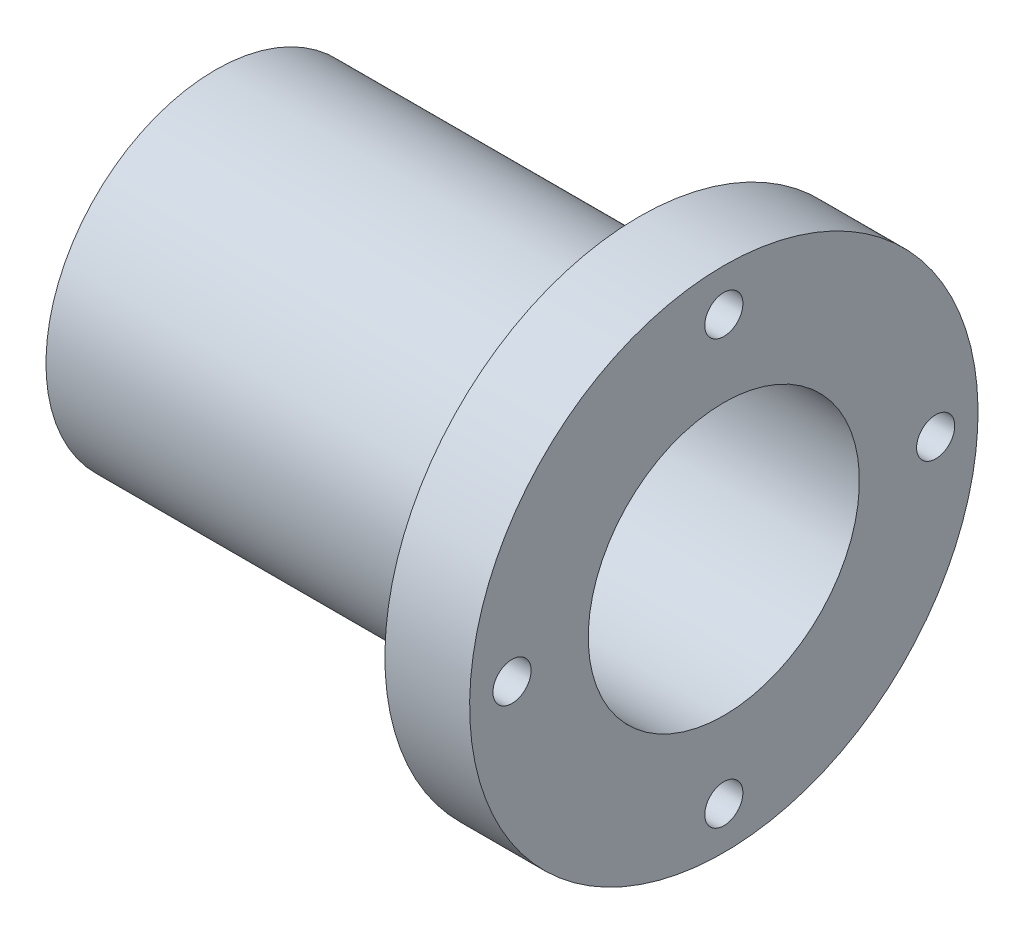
from build123d import *

# Parameters (mm, degrees)
SKETCH_2_R                   = 16
CUT_EXTRUDE_1_DEPTH          = 84.666002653
HOLE_WIZARD_M4_1_D           = 4.5
HOLE_WIZARD_M4_1_CBORE_D     = 8
HOLE_WIZARD_M4_1_CBORE_DEPTH = 4
PATTERN_CIRCULAR_1_COUNT     = 4


with BuildPart() as part:
    # Sketch 1 → Revolve 1 (revolve)
    with BuildSketch(Plane.XY):
        Polygon((0, 0), (50, 0), (50, 10), (60, 10), (60, -20), (0, -20), align=None)
    revolve(axis=Axis((60, -20, 0), (-1, 0, 0)))

    # Sketch 2 → Cut-Extrude 1 (cut, through all)
    with BuildSketch(Plane.ZY):
        with Locations(Location((0, -20, 0), (0, 0, 270))):
            Circle(SKETCH_2_R)
    extrude(amount=-CUT_EXTRUDE_1_DEPTH, mode=Mode.SUBTRACT)

    # Hole Wizard M4 _1 (through all)
    with Locations(Plane.ZY.offset(-50)):
        with Locations((0, 5)):
            hole_wizard_m4_1 = CounterBoreHole(HOLE_WIZARD_M4_1_D / 2, HOLE_WIZARD_M4_1_CBORE_D / 2, HOLE_WIZARD_M4_1_CBORE_DEPTH)

    # Pattern Circular 1: Hole Wizard M4 _1 ×4 about axis
    pattern_circular_1_axis = Axis((0, -20, 0), (1, 0, 0))
    for i in range(1, PATTERN_CIRCULAR_1_COUNT):
        add(hole_wizard_m4_1.rotate(pattern_circular_1_axis, i * 360 / PATTERN_CIRCULAR_1_COUNT), mode=Mode.SUBTRACT)


solid = part.part
